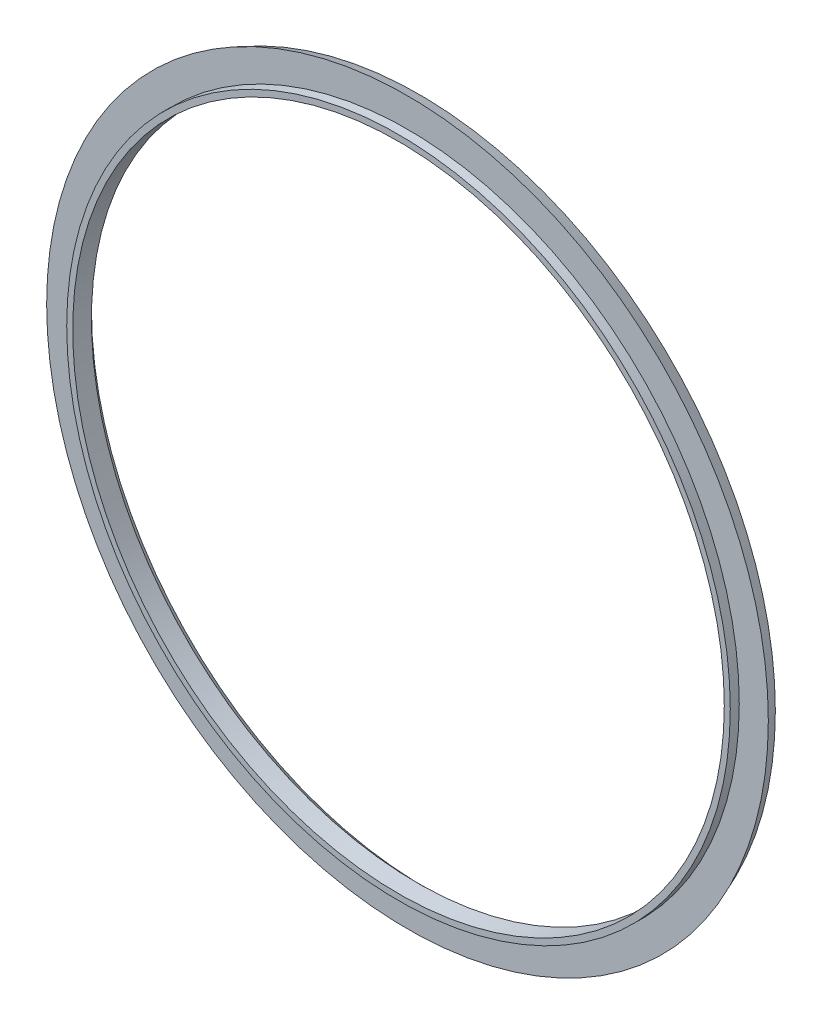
from build123d import *


with BuildPart() as part:
    # Sketch1 → Revolve1 (revolve)
    with BuildSketch(Plane(origin=(0, 0, 0), x_dir=(0, 0, -1), z_dir=(1, 0, 0)), mode=Mode.PRIVATE) as revolve1_sk:
        Polygon((38.85838842, 87.83894257), (36.47713842, 87.83894257), (36.47713842, 86.25144257), (41.435304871, 86.25144257), (43.60818842, 88.424326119), (43.60818842, 89.948326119), (42.03338842, 90.750726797), (42.03338842, 94.215617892), (38.85838842, 95.530745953), align=None)
    revolve(revolve1_sk.sketch.rotate(Axis((0, 0, 0), (0, 0, -1)), 90), axis=Axis((0, 0, 0), (0, 0, -1)))


solid = part.part
